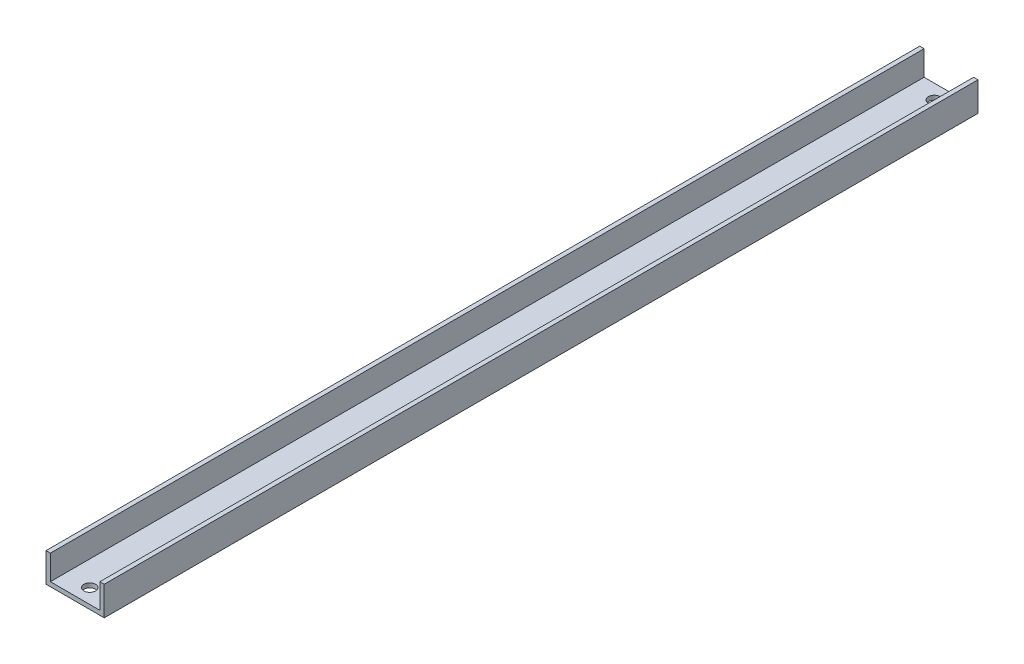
from build123d import *

# Parameters (mm, degrees)
EXTRUSION1_DEPTH        = 300
ESQUISSE2_R             = 2
ENL_V_MAT_EXTRU_1_DEPTH = 301.333148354


with BuildPart() as part:
    # Esquisse1 → Extrusion1 (new body)
    with BuildSketch(Plane.XY):
        Polygon((10, 0), (-10, 0), (-10, 10), (-8.5, 10), (-8.5, 1.5), (8.5, 1.5), (8.5, 10), (10, 10), align=None)
    extrude(amount=EXTRUSION1_DEPTH)

    # Esquisse2 → Enl_v. mat.-Extru.1 (cut, through all)
    with BuildSketch(Plane.XZ):
        with Locations(Location((0, 5, 0), (0, 0, 270))):
            Circle(ESQUISSE2_R)
        with Locations(Location((0, 295, 0), (0, 0, 270))):
            Circle(ESQUISSE2_R)
    extrude(amount=-ENL_V_MAT_EXTRU_1_DEPTH, mode=Mode.SUBTRACT)


solid = part.part
